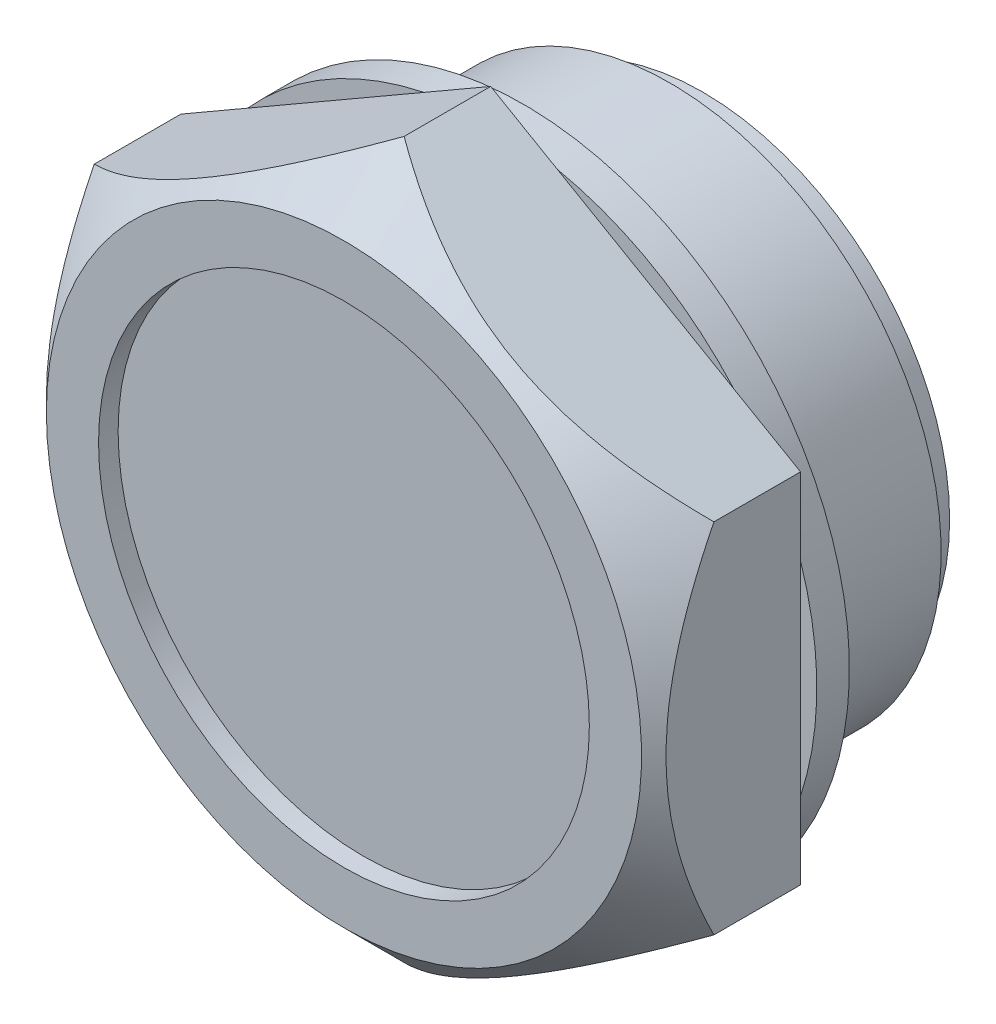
ISO-10303-21;
HEADER;
FILE_DESCRIPTION(('STEP AP214'),'2;1');
FILE_NAME('part.step','',(''),(''),'','','');
FILE_SCHEMA(('AUTOMOTIVE_DESIGN { 1 0 10303 214 1 1 1 1 }'));
ENDSEC;
DATA;
#1=APPLICATION_CONTEXT('core data for automotive mechanical design processes');
#2=APPLICATION_PROTOCOL_DEFINITION('international standard','automotive_design',2000,#1);
#3=PRODUCT_CONTEXT('',#1,'mechanical');
#4=PRODUCT('Part','Part','',(#3));
#5=PRODUCT_RELATED_PRODUCT_CATEGORY('part','',(#4));
#6=PRODUCT_DEFINITION_FORMATION('','',#4);
#7=PRODUCT_DEFINITION_CONTEXT('part definition',#1,'design');
#8=PRODUCT_DEFINITION('design','',#6,#7);
#9=PRODUCT_DEFINITION_SHAPE('','',#8);
#10=(LENGTH_UNIT() NAMED_UNIT(*) SI_UNIT(.MILLI.,.METRE.));
#11=(NAMED_UNIT(*) PLANE_ANGLE_UNIT() SI_UNIT($,.RADIAN.));
#12=(NAMED_UNIT(*) SI_UNIT($,.STERADIAN.) SOLID_ANGLE_UNIT());
#13=UNCERTAINTY_MEASURE_WITH_UNIT(LENGTH_MEASURE(1.E-05),#10,'distance_accuracy_value','');
#14=(GEOMETRIC_REPRESENTATION_CONTEXT(3) GLOBAL_UNCERTAINTY_ASSIGNED_CONTEXT((#13)) GLOBAL_UNIT_ASSIGNED_CONTEXT((#10,
#11,#12)) REPRESENTATION_CONTEXT('',''));
#15=CARTESIAN_POINT('',(0.,0.,0.));
#16=DIRECTION('',(0.,0.,1.));
#17=DIRECTION('',(1.,0.,0.));
#18=AXIS2_PLACEMENT_3D('',#15,#16,#17);
#19=CARTESIAN_POINT('',(0.,20.,2.));
#20=DIRECTION('',(0.,0.,-1.));
#21=DIRECTION('',(-1.,0.,0.));
#22=AXIS2_PLACEMENT_3D('',#19,#20,#21);
#23=PLANE('',#22);
#24=DIRECTION('',(-0.866025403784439,-0.5,0.));
#25=VECTOR('',#24,1.);
#26=CARTESIAN_POINT('',(19.0000000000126,-10.9696551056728,2.));
#27=LINE('',#26,#25);
#28=CARTESIAN_POINT('',(4.09167306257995,-19.5769816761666,2.));
#29=VERTEX_POINT('',#28);
#30=CARTESIAN_POINT('',(1.54832674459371E-08,-21.9393102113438,2.));
#31=VERTEX_POINT('',#30);
#32=EDGE_CURVE('E114',#29,#31,#27,.T.);
#33=ORIENTED_EDGE('',*,*,#32,.T.);
#34=DIRECTION('',(-0.866025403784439,0.5,0.));
#35=VECTOR('',#34,1.);
#36=CARTESIAN_POINT('',(1.54832674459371E-08,-21.9393102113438,2.));
#37=LINE('',#36,#35);
#38=CARTESIAN_POINT('',(-4.0916730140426,-19.576981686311,2.));
#39=VERTEX_POINT('',#38);
#40=EDGE_CURVE('E125',#31,#39,#37,.T.);
#41=ORIENTED_EDGE('',*,*,#40,.T.);
#42=CARTESIAN_POINT('',(0.,0.,2.));
#43=DIRECTION('',(0.,0.,-1.));
#44=DIRECTION('',(-1.,0.,0.));
#45=AXIS2_PLACEMENT_3D('',#42,#43,#44);
#46=CIRCLE('',#45,20.);
#47=EDGE_CURVE('E136',#29,#39,#46,.T.);
#48=ORIENTED_EDGE('',*,*,#47,.F.);
#49=EDGE_LOOP('',(#33,#41,#48));
#50=FACE_BOUND('',#49,.T.);
#51=ADVANCED_FACE('F15',(#50),#23,.T.);
#52=CARTESIAN_POINT('',(-14.9083269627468,-13.3319836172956,2.));
#53=VERTEX_POINT('',#52);
#54=CARTESIAN_POINT('',(-18.9999999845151,-10.9696550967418,2.));
#55=VERTEX_POINT('',#54);
#56=EDGE_CURVE('E135',#53,#55,#37,.T.);
#57=ORIENTED_EDGE('',*,*,#56,.T.);
#58=DIRECTION('',(0.,1.,0.));
#59=VECTOR('',#58,1.);
#60=CARTESIAN_POINT('',(-18.9999999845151,-10.9696550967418,2.));
#61=LINE('',#60,#59);
#62=CARTESIAN_POINT('',(-18.9999999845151,-6.24499804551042,2.));
#63=VERTEX_POINT('',#62);
#64=EDGE_CURVE('E164',#55,#63,#61,.T.);
#65=ORIENTED_EDGE('',*,*,#64,.T.);
#66=EDGE_CURVE('E209',#53,#63,#46,.T.);
#67=ORIENTED_EDGE('',*,*,#66,.F.);
#68=EDGE_LOOP('',(#57,#65,#67));
#69=FACE_BOUND('',#68,.T.);
#70=ADVANCED_FACE('F315',(#69),#23,.T.);
#71=CARTESIAN_POINT('',(-18.9999999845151,6.2449980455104,2.));
#72=VERTEX_POINT('',#71);
#73=CARTESIAN_POINT('',(-18.9999999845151,10.9696551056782,2.));
#74=VERTEX_POINT('',#73);
#75=EDGE_CURVE('E133',#72,#74,#61,.T.);
#76=ORIENTED_EDGE('',*,*,#75,.T.);
#77=DIRECTION('',(0.866025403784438,0.5,0.));
#78=VECTOR('',#77,1.);
#79=CARTESIAN_POINT('',(-18.9999999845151,10.9696551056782,2.));
#80=LINE('',#79,#78);
#81=CARTESIAN_POINT('',(-14.908326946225,13.331983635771,2.));
#82=VERTEX_POINT('',#81);
#83=EDGE_CURVE('E169',#74,#82,#80,.T.);
#84=ORIENTED_EDGE('',*,*,#83,.T.);
#85=EDGE_CURVE('E210',#72,#82,#46,.T.);
#86=ORIENTED_EDGE('',*,*,#85,.F.);
#87=EDGE_LOOP('',(#76,#84,#86));
#88=FACE_BOUND('',#87,.T.);
#89=ADVANCED_FACE('F320',(#88),#23,.T.);
#90=CARTESIAN_POINT('',(-4.09167303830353,19.5769816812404,2.));
#91=VERTEX_POINT('',#90);
#92=CARTESIAN_POINT('',(1.37390099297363E-12,21.9393102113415,2.));
#93=VERTEX_POINT('',#92);
#94=EDGE_CURVE('E167',#91,#93,#80,.T.);
#95=ORIENTED_EDGE('',*,*,#94,.T.);
#96=DIRECTION('',(0.866025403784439,-0.5,0.));
#97=VECTOR('',#96,1.);
#98=CARTESIAN_POINT('',(1.37390099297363E-12,21.9393102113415,2.));
#99=LINE('',#98,#97);
#100=CARTESIAN_POINT('',(4.09167303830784,19.5769816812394,2.));
#101=VERTEX_POINT('',#100);
#102=EDGE_CURVE('E175',#93,#101,#99,.T.);
#103=ORIENTED_EDGE('',*,*,#102,.T.);
#104=EDGE_CURVE('E215',#91,#101,#46,.T.);
#105=ORIENTED_EDGE('',*,*,#104,.F.);
#106=EDGE_LOOP('',(#95,#103,#105));
#107=FACE_BOUND('',#106,.T.);
#108=ADVANCED_FACE('F334',(#107),#23,.T.);
#109=CARTESIAN_POINT('',(19.0000000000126,-10.9696551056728,2.));
#110=VERTEX_POINT('',#109);
#111=CARTESIAN_POINT('',(14.9083269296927,-13.331983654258,2.));
#112=VERTEX_POINT('',#111);
#113=EDGE_CURVE('E142',#110,#112,#27,.T.);
#114=ORIENTED_EDGE('',*,*,#113,.T.);
#115=CARTESIAN_POINT('',(18.9999999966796,-6.24499800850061,2.));
#116=VERTEX_POINT('',#115);
#117=EDGE_CURVE('E599',#116,#112,#46,.T.);
#118=ORIENTED_EDGE('',*,*,#117,.F.);
#119=DIRECTION('',(7.05455941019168E-10,-1.,0.));
#120=VECTOR('',#119,1.);
#121=CARTESIAN_POINT('',(18.9999999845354,10.969655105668,2.));
#122=LINE('',#121,#120);
#123=EDGE_CURVE('E179',#116,#110,#122,.T.);
#124=ORIENTED_EDGE('',*,*,#123,.T.);
#125=EDGE_LOOP('',(#114,#118,#124));
#126=FACE_BOUND('',#125,.T.);
#127=ADVANCED_FACE('F325',(#126),#23,.T.);
#128=CARTESIAN_POINT('',(0.,0.,-11.));
#129=DIRECTION('',(0.,0.,-1.));
#130=DIRECTION('',(-1.,0.,0.));
#131=AXIS2_PLACEMENT_3D('',#128,#129,#130);
#132=PLANE('',#131);
#133=CARTESIAN_POINT('',(0.,0.,-11.));
#134=DIRECTION('',(0.,0.,-1.));
#135=DIRECTION('',(-1.,0.,0.));
#136=AXIS2_PLACEMENT_3D('',#133,#134,#135);
#137=CIRCLE('',#136,15.1455);
#138=CARTESIAN_POINT('',(-15.1455,0.,-11.));
#139=VERTEX_POINT('',#138);
#140=EDGE_CURVE('E231',#139,#139,#137,.T.);
#141=ORIENTED_EDGE('',*,*,#140,.T.);
#142=EDGE_LOOP('',(#141));
#143=FACE_BOUND('',#142,.T.);
#144=ADVANCED_FACE('F17',(#143),#132,.T.);
#145=CARTESIAN_POINT('',(0.,0.,-21.));
#146=DIRECTION('',(0.,0.,-1.));
#147=DIRECTION('',(-1.,0.,0.));
#148=AXIS2_PLACEMENT_3D('',#145,#146,#147);
#149=CYLINDRICAL_SURFACE('',#148,15.1455);
#150=ORIENTED_EDGE('',*,*,#140,.F.);
#151=EDGE_LOOP('',(#150));
#152=FACE_BOUND('',#151,.T.);
#153=CARTESIAN_POINT('',(0.,0.,-9.));
#154=DIRECTION('',(0.,0.,-1.));
#155=DIRECTION('',(-1.,0.,0.));
#156=AXIS2_PLACEMENT_3D('',#153,#154,#155);
#157=CIRCLE('',#156,15.1455);
#158=CARTESIAN_POINT('',(-15.1455,0.,-9.));
#159=VERTEX_POINT('',#158);
#160=EDGE_CURVE('E227',#159,#159,#157,.T.);
#161=ORIENTED_EDGE('',*,*,#160,.T.);
#162=EDGE_LOOP('',(#161));
#163=FACE_BOUND('',#162,.T.);
#164=ADVANCED_FACE('F340',(#152,#163),#149,.T.);
#165=CARTESIAN_POINT('',(0.,15.1455,-9.));
#166=DIRECTION('',(0.,0.,-1.));
#167=DIRECTION('',(-1.,0.,0.));
#168=AXIS2_PLACEMENT_3D('',#165,#166,#167);
#169=PLANE('',#168);
#170=CARTESIAN_POINT('',(0.,0.,-9.));
#171=DIRECTION('',(0.,0.,-1.));
#172=DIRECTION('',(-1.,0.,0.));
#173=AXIS2_PLACEMENT_3D('',#170,#171,#172);
#174=CIRCLE('',#173,16.6245);
#175=CARTESIAN_POINT('',(-16.6245,0.,-9.));
#176=VERTEX_POINT('',#175);
#177=EDGE_CURVE('E223',#176,#176,#174,.T.);
#178=ORIENTED_EDGE('',*,*,#177,.T.);
#179=EDGE_LOOP('',(#178));
#180=FACE_BOUND('',#179,.T.);
#181=ORIENTED_EDGE('',*,*,#160,.F.);
#182=EDGE_LOOP('',(#181));
#183=FACE_BOUND('',#182,.T.);
#184=ADVANCED_FACE('F537',(#180,#183),#169,.T.);
#185=CARTESIAN_POINT('',(0.,0.,-21.));
#186=DIRECTION('',(0.,0.,-1.));
#187=DIRECTION('',(-1.,0.,0.));
#188=AXIS2_PLACEMENT_3D('',#185,#186,#187);
#189=CYLINDRICAL_SURFACE('',#188,16.6245);
#190=ORIENTED_EDGE('',*,*,#177,.F.);
#191=EDGE_LOOP('',(#190));
#192=FACE_BOUND('',#191,.T.);
#193=CARTESIAN_POINT('',(0.,0.,0.));
#194=DIRECTION('',(0.,0.,-1.));
#195=DIRECTION('',(-1.,0.,0.));
#196=AXIS2_PLACEMENT_3D('',#193,#194,#195);
#197=CIRCLE('',#196,16.6245);
#198=CARTESIAN_POINT('',(-16.6245,0.,0.));
#199=VERTEX_POINT('',#198);
#200=EDGE_CURVE('E219',#199,#199,#197,.T.);
#201=ORIENTED_EDGE('',*,*,#200,.T.);
#202=EDGE_LOOP('',(#201));
#203=FACE_BOUND('',#202,.T.);
#204=ADVANCED_FACE('F529',(#192,#203),#189,.T.);
#205=CARTESIAN_POINT('',(0.,16.6245,0.));
#206=DIRECTION('',(0.,0.,-1.));
#207=DIRECTION('',(-1.,0.,0.));
#208=AXIS2_PLACEMENT_3D('',#205,#206,#207);
#209=PLANE('',#208);
#210=CARTESIAN_POINT('',(0.,0.,0.));
#211=DIRECTION('',(0.,0.,-1.));
#212=DIRECTION('',(-1.,0.,0.));
#213=AXIS2_PLACEMENT_3D('',#210,#211,#212);
#214=CIRCLE('',#213,20.);
#215=CARTESIAN_POINT('',(-20.,0.,0.));
#216=VERTEX_POINT('',#215);
#217=EDGE_CURVE('E214',#216,#216,#214,.T.);
#218=ORIENTED_EDGE('',*,*,#217,.T.);
#219=EDGE_LOOP('',(#218));
#220=FACE_BOUND('',#219,.T.);
#221=ORIENTED_EDGE('',*,*,#200,.F.);
#222=EDGE_LOOP('',(#221));
#223=FACE_BOUND('',#222,.T.);
#224=ADVANCED_FACE('F330',(#220,#223),#209,.T.);
#225=CARTESIAN_POINT('',(0.,0.,-21.));
#226=DIRECTION('',(0.,0.,-1.));
#227=DIRECTION('',(-1.,0.,0.));
#228=AXIS2_PLACEMENT_3D('',#225,#226,#227);
#229=CYLINDRICAL_SURFACE('',#228,20.);
#230=ORIENTED_EDGE('',*,*,#85,.T.);
#231=CARTESIAN_POINT('',(0.,0.,2.));
#232=DIRECTION('',(0.,0.,-1.));
#233=DIRECTION('',(-1.,0.,0.));
#234=AXIS2_PLACEMENT_3D('',#231,#232,#233);
#235=CIRCLE('',#234,20.);
#236=EDGE_CURVE('E203',#91,#82,#235,.F.);
#237=ORIENTED_EDGE('',*,*,#236,.F.);
#238=ORIENTED_EDGE('',*,*,#104,.T.);
#239=CARTESIAN_POINT('',(14.908326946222,13.3319836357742,2.));
#240=VERTEX_POINT('',#239);
#241=EDGE_CURVE('E378',#240,#101,#235,.F.);
#242=ORIENTED_EDGE('',*,*,#241,.F.);
#243=CARTESIAN_POINT('',(18.9999999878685,6.24499803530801,2.));
#244=VERTEX_POINT('',#243);
#245=EDGE_CURVE('E395',#240,#244,#46,.T.);
#246=ORIENTED_EDGE('',*,*,#245,.T.);
#247=EDGE_CURVE('E375',#116,#244,#235,.F.);
#248=ORIENTED_EDGE('',*,*,#247,.F.);
#249=ORIENTED_EDGE('',*,*,#117,.T.);
#250=EDGE_CURVE('E373',#29,#112,#235,.F.);
#251=ORIENTED_EDGE('',*,*,#250,.F.);
#252=ORIENTED_EDGE('',*,*,#47,.T.);
#253=EDGE_CURVE('E204',#53,#39,#235,.F.);
#254=ORIENTED_EDGE('',*,*,#253,.F.);
#255=ORIENTED_EDGE('',*,*,#66,.T.);
#256=EDGE_CURVE('E120',#72,#63,#235,.F.);
#257=ORIENTED_EDGE('',*,*,#256,.F.);
#258=EDGE_LOOP('',(#230,#237,#238,#242,#246,#248,#249,#251,#252,#254,#255,#257));
#259=FACE_BOUND('',#258,.T.);
#260=ORIENTED_EDGE('',*,*,#217,.F.);
#261=EDGE_LOOP('',(#260));
#262=FACE_BOUND('',#261,.T.);
#263=ADVANCED_FACE('F323',(#259,#262),#229,.T.);
#264=CARTESIAN_POINT('',(18.9999999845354,10.969655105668,2.));
#265=VERTEX_POINT('',#264);
#266=EDGE_CURVE('E173',#240,#265,#99,.T.);
#267=ORIENTED_EDGE('',*,*,#266,.T.);
#268=EDGE_CURVE('E181',#265,#244,#122,.T.);
#269=ORIENTED_EDGE('',*,*,#268,.T.);
#270=ORIENTED_EDGE('',*,*,#245,.F.);
#271=EDGE_LOOP('',(#267,#269,#270));
#272=FACE_BOUND('',#271,.T.);
#273=ADVANCED_FACE('F300',(#272),#23,.T.);
#274=CARTESIAN_POINT('',(-30.,-30.,2.));
#275=DIRECTION('',(0.,0.,-1.));
#276=DIRECTION('',(-1.,0.,0.));
#277=AXIS2_PLACEMENT_3D('',#274,#275,#276);
#278=PLANE('',#277);
#279=ORIENTED_EDGE('',*,*,#236,.T.);
#280=EDGE_CURVE('E174',#82,#91,#80,.T.);
#281=ORIENTED_EDGE('',*,*,#280,.T.);
#282=EDGE_LOOP('',(#279,#281));
#283=FACE_BOUND('',#282,.T.);
#284=ADVANCED_FACE('F297',(#283),#278,.F.);
#285=ORIENTED_EDGE('',*,*,#241,.T.);
#286=EDGE_CURVE('E180',#101,#240,#99,.T.);
#287=ORIENTED_EDGE('',*,*,#286,.T.);
#288=EDGE_LOOP('',(#285,#287));
#289=FACE_BOUND('',#288,.T.);
#290=ADVANCED_FACE('F299',(#289),#278,.F.);
#291=ORIENTED_EDGE('',*,*,#247,.T.);
#292=EDGE_CURVE('E37',#244,#116,#122,.T.);
#293=ORIENTED_EDGE('',*,*,#292,.T.);
#294=EDGE_LOOP('',(#291,#293));
#295=FACE_BOUND('',#294,.T.);
#296=ADVANCED_FACE('F397',(#295),#278,.F.);
#297=ORIENTED_EDGE('',*,*,#250,.T.);
#298=EDGE_CURVE('E139',#112,#29,#27,.T.);
#299=ORIENTED_EDGE('',*,*,#298,.T.);
#300=EDGE_LOOP('',(#297,#299));
#301=FACE_BOUND('',#300,.T.);
#302=ADVANCED_FACE('F402',(#301),#278,.F.);
#303=ORIENTED_EDGE('',*,*,#253,.T.);
#304=EDGE_CURVE('E128',#39,#53,#37,.T.);
#305=ORIENTED_EDGE('',*,*,#304,.T.);
#306=EDGE_LOOP('',(#303,#305));
#307=FACE_BOUND('',#306,.T.);
#308=ADVANCED_FACE('F407',(#307),#278,.F.);
#309=ORIENTED_EDGE('',*,*,#256,.T.);
#310=EDGE_CURVE('E168',#63,#72,#61,.T.);
#311=ORIENTED_EDGE('',*,*,#310,.T.);
#312=EDGE_LOOP('',(#309,#311));
#313=FACE_BOUND('',#312,.T.);
#314=ADVANCED_FACE('F302',(#313),#278,.F.);
#315=CARTESIAN_POINT('',(19.0000000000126,-10.9696551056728,2.));
#316=DIRECTION('',(-0.5,0.866025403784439,0.));
#317=DIRECTION('',(0.866025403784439,0.5,0.));
#318=AXIS2_PLACEMENT_3D('',#315,#316,#317);
#319=PLANE('',#318);
#320=DIRECTION('',(0.,0.,1.));
#321=VECTOR('',#320,1.);
#322=CARTESIAN_POINT('',(1.54832674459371E-08,-21.9393102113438,2.));
#323=LINE('',#322,#321);
#324=CARTESIAN_POINT('',(1.54832674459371E-08,-21.9393102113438,7.3106897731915));
#325=VERTEX_POINT('',#324);
#326=EDGE_CURVE('E109',#31,#325,#323,.T.);
#327=ORIENTED_EDGE('',*,*,#326,.F.);
#328=ORIENTED_EDGE('',*,*,#32,.F.);
#329=ORIENTED_EDGE('',*,*,#298,.F.);
#330=ORIENTED_EDGE('',*,*,#113,.F.);
#331=DIRECTION('',(0.,0.,1.));
#332=VECTOR('',#331,1.);
#333=CARTESIAN_POINT('',(19.0000000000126,-10.9696551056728,2.));
#334=LINE('',#333,#332);
#335=CARTESIAN_POINT('',(19.0000000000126,-10.9696551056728,7.3106897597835));
#336=VERTEX_POINT('',#335);
#337=EDGE_CURVE('E185',#110,#336,#334,.T.);
#338=ORIENTED_EDGE('',*,*,#337,.T.);
#339=CARTESIAN_POINT('',(-0.000199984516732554,-21.9394256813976,7.3105743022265));
#340=CARTESIAN_POINT('',(0.326448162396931,-21.7508352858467,7.49913513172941));
#341=CARTESIAN_POINT('',(0.655654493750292,-21.5607679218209,7.68194200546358));
#342=CARTESIAN_POINT('',(1.31958163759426,-21.1774494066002,8.03422015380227));
#343=CARTESIAN_POINT('',(1.65430534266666,-20.9841965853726,8.20368414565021));
#344=CARTESIAN_POINT('',(2.33124402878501,-20.5933658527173,8.52816648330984));
#345=CARTESIAN_POINT('',(2.67349092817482,-20.3957695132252,8.68309656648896));
#346=CARTESIAN_POINT('',(3.36360611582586,-19.9973313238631,8.97514614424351));
#347=CARTESIAN_POINT('',(3.71147353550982,-19.7964899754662,9.11226836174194));
#348=CARTESIAN_POINT('',(4.40723537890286,-19.3947916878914,9.36436398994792));
#349=CARTESIAN_POINT('',(4.75504431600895,-19.1939841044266,9.4796502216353));
#350=CARTESIAN_POINT('',(5.45554162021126,-18.7895517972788,9.68836448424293));
#351=CARTESIAN_POINT('',(5.80822946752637,-18.5859273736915,9.78179482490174));
#352=CARTESIAN_POINT('',(6.51695983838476,-18.1767417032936,9.94444948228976));
#353=CARTESIAN_POINT('',(6.87299292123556,-17.9711859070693,10.0137283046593));
#354=CARTESIAN_POINT('',(7.5880927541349,-17.5583228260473,10.1265403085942));
#355=CARTESIAN_POINT('',(7.94715904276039,-17.3510158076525,10.1700773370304));
#356=CARTESIAN_POINT('',(8.56458968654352,-16.9945420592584,10.2216376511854));
#357=CARTESIAN_POINT('',(8.82255417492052,-16.8456061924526,10.2362393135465));
#358=CARTESIAN_POINT('',(9.3387879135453,-16.5475585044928,10.2514232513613));
#359=CARTESIAN_POINT('',(9.59705714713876,-16.3984466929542,10.2520062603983));
#360=CARTESIAN_POINT('',(10.1134238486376,-16.1003222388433,10.2391389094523));
#361=CARTESIAN_POINT('',(10.3715212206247,-15.9513096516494,10.2256834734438));
#362=CARTESIAN_POINT('',(10.8868961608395,-15.6537577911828,10.1849400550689));
#363=CARTESIAN_POINT('',(11.1441737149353,-15.5052185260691,10.1576518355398));
#364=CARTESIAN_POINT('',(11.6576545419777,-15.2087602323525,10.0896114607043));
#365=CARTESIAN_POINT('',(11.9138564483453,-15.0608419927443,10.048845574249));
#366=CARTESIAN_POINT('',(12.4244831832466,-14.7660315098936,9.95443818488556));
#367=CARTESIAN_POINT('',(12.6789078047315,-14.6191393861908,9.90079520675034));
#368=CARTESIAN_POINT('',(13.438826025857,-14.1804003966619,9.72160211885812));
#369=CARTESIAN_POINT('',(13.9411555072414,-13.8903803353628,9.5777615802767));
#370=CARTESIAN_POINT('',(14.8327595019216,-13.3756125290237,9.28185516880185));
#371=CARTESIAN_POINT('',(15.2240256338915,-13.149714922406,9.13757396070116));
#372=CARTESIAN_POINT('',(15.9995498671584,-12.7019657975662,8.82576281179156));
#373=CARTESIAN_POINT('',(16.3838077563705,-12.4801144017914,8.65823216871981));
#374=CARTESIAN_POINT('',(17.1440862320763,-12.0411674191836,8.30367760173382));
#375=CARTESIAN_POINT('',(17.5201284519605,-11.8240593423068,8.11671498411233));
#376=CARTESIAN_POINT('',(18.2652503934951,-11.3938629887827,7.7257504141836));
#377=CARTESIAN_POINT('',(18.6343342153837,-11.1807723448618,7.52175890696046));
#378=CARTESIAN_POINT('',(19.0002000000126,-10.969539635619,7.310574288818));
#379=B_SPLINE_CURVE_WITH_KNOTS('',3,(#339,#340,#341,#342,#343,#344,#345,#346,#347,#348,#349,
#350,#351,#352,#353,#354,#355,#356,#357,#358,#359,#360,#361,#362,#363,#364,#365,#366,#367,#368,
#369,#370,#371,#372,#373,#374,#375,#376,#377,#378),.UNSPECIFIED.,.F.,.F.,(4,2,2,2,2,2,2,2,2,2,2,
2,2,2,2,2,2,2,2,4),(0.,1.26511678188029,2.53091936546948,3.80396921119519,5.07682417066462,
6.3297748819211,7.58259312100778,8.83256538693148,10.0823508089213,10.9767333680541,
11.8710691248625,12.7657283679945,13.660402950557,14.5559918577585,15.4516834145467,
17.2424005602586,18.6645955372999,20.0868334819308,21.5047132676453,22.9217296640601),.UNSPECIFIED.);
#380=EDGE_CURVE('E9',#325,#336,#379,.T.);
#381=ORIENTED_EDGE('',*,*,#380,.F.);
#382=EDGE_LOOP('',(#327,#328,#329,#330,#338,#381));
#383=FACE_BOUND('',#382,.T.);
#384=ADVANCED_FACE('F111',(#383),#319,.F.);
#385=CARTESIAN_POINT('',(1.54832674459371E-08,-21.9393102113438,2.));
#386=DIRECTION('',(0.5,0.866025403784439,0.));
#387=DIRECTION('',(0.866025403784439,-0.5,0.));
#388=AXIS2_PLACEMENT_3D('',#385,#386,#387);
#389=PLANE('',#388);
#390=DIRECTION('',(0.,0.,1.));
#391=VECTOR('',#390,1.);
#392=CARTESIAN_POINT('',(-18.9999999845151,-10.9696550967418,2.));
#393=LINE('',#392,#391);
#394=CARTESIAN_POINT('',(-18.9999999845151,-10.9696550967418,7.3106897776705));
#395=VERTEX_POINT('',#394);
#396=EDGE_CURVE('E121',#55,#395,#393,.T.);
#397=ORIENTED_EDGE('',*,*,#396,.F.);
#398=ORIENTED_EDGE('',*,*,#56,.F.);
#399=ORIENTED_EDGE('',*,*,#304,.F.);
#400=ORIENTED_EDGE('',*,*,#40,.F.);
#401=ORIENTED_EDGE('',*,*,#326,.T.);
#402=CARTESIAN_POINT('',(-19.0001999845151,-10.969539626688,7.310574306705));
#403=CARTESIAN_POINT('',(-18.6735518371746,-11.1581300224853,7.4991351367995));
#404=CARTESIAN_POINT('',(-18.3443455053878,-11.3481973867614,7.68194201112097));
#405=CARTESIAN_POINT('',(-17.6804183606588,-11.731515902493,8.03422016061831));
#406=CARTESIAN_POINT('',(-17.3456946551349,-11.9247687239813,8.20368415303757));
#407=CARTESIAN_POINT('',(-16.6687559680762,-12.3155994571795,8.52816649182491));
#408=CARTESIAN_POINT('',(-16.3265090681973,-12.513195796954,8.68309657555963));
#409=CARTESIAN_POINT('',(-15.6363938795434,-12.9116339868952,8.97514615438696));
#410=CARTESIAN_POINT('',(-15.2885264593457,-13.1124753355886,9.11226837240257));
#411=CARTESIAN_POINT('',(-14.5927646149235,-13.5141736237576,9.36436400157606));
#412=CARTESIAN_POINT('',(-14.2449556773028,-13.7149812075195,9.47965023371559));
#413=CARTESIAN_POINT('',(-13.5444583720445,-14.119413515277,9.68836449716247));
#414=CARTESIAN_POINT('',(-13.191770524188,-14.3230379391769,9.78179483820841));
#415=CARTESIAN_POINT('',(-12.4830401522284,-14.7322236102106,9.94444949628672));
#416=CARTESIAN_POINT('',(-12.127007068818,-14.937779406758,10.01372831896));
#417=CARTESIAN_POINT('',(-11.4119072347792,-15.3506424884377,10.1265403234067));
#418=CARTESIAN_POINT('',(-11.052840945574,-15.5579495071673,10.1700773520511));
#419=CARTESIAN_POINT('',(-10.4354103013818,-15.9144232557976,10.2216376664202));
#420=CARTESIAN_POINT('',(-10.1774458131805,-16.063359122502,10.2362393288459));
#421=CARTESIAN_POINT('',(-9.66121207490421,-16.3614068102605,10.251423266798));
#422=CARTESIAN_POINT('',(-9.40294284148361,-16.5105186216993,10.2520062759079));
#423=CARTESIAN_POINT('',(-8.88657614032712,-16.8086430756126,10.2391389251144));
#424=CARTESIAN_POINT('',(-8.62847876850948,-16.9576556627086,10.2256834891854));
#425=CARTESIAN_POINT('',(-8.11310382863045,-17.2552075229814,10.1849400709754));
#426=CARTESIAN_POINT('',(-7.85582627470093,-17.403746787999,10.1576518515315));
#427=CARTESIAN_POINT('',(-7.34234544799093,-17.7002050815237,10.0896114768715));
#428=CARTESIAN_POINT('',(-7.08614354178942,-17.8481233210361,10.0488455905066));
#429=CARTESIAN_POINT('',(-6.57551680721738,-18.1429338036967,9.95443820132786));
#430=CARTESIAN_POINT('',(-6.32109218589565,-18.2898259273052,9.90079522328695));
#431=CARTESIAN_POINT('',(-5.5611739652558,-18.7285649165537,9.72160213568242));
#432=CARTESIAN_POINT('',(-5.05884448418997,-19.0185849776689,9.57776159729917));
#433=CARTESIAN_POINT('',(-4.1672404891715,-19.5333527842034,9.28185518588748));
#434=CARTESIAN_POINT('',(-3.77597435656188,-19.7592503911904,9.13757397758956));
#435=CARTESIAN_POINT('',(-3.00045012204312,-20.2069995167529,8.82576282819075));
#436=CARTESIAN_POINT('',(-2.61619223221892,-20.4288509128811,8.65823218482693));
#437=CARTESIAN_POINT('',(-1.85591375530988,-20.8677978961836,8.30367761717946));
#438=CARTESIAN_POINT('',(-1.47987153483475,-21.0849059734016,8.1167149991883));
#439=CARTESIAN_POINT('',(-0.734749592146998,-21.5151023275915,7.72575042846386));
#440=CARTESIAN_POINT('',(-0.365665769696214,-21.728192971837,7.52175892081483));
#441=CARTESIAN_POINT('',(0.000200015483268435,-21.9394256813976,7.310574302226));
#442=B_SPLINE_CURVE_WITH_KNOTS('',3,(#402,#403,#404,#405,#406,#407,#408,#409,#410,#411,#412,
#413,#414,#415,#416,#417,#418,#419,#420,#421,#422,#423,#424,#425,#426,#427,#428,#429,#430,#431,
#432,#433,#434,#435,#436,#437,#438,#439,#440,#441),.UNSPECIFIED.,.F.,.F.,(4,2,2,2,2,2,2,2,2,2,2,
2,2,2,2,2,2,2,2,4),(0.,1.26511678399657,2.53091936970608,3.80396921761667,5.0768241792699,
6.32977489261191,7.58259313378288,8.83256540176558,10.0823508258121,10.976733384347,
11.8710691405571,12.765728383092,13.6604029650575,14.555991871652,15.4516834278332,
17.2424005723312,18.6645955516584,20.0868334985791,21.5047132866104,22.9217296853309),.UNSPECIFIED.);
#443=EDGE_CURVE('E30',#395,#325,#442,.T.);
#444=ORIENTED_EDGE('',*,*,#443,.F.);
#445=EDGE_LOOP('',(#397,#398,#399,#400,#401,#444));
#446=FACE_BOUND('',#445,.T.);
#447=ADVANCED_FACE('F126',(#446),#389,.F.);
#448=CARTESIAN_POINT('',(-18.9999999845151,-10.9696550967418,2.));
#449=DIRECTION('',(1.,0.,0.));
#450=DIRECTION('',(0.,0.,-1.));
#451=AXIS2_PLACEMENT_3D('',#448,#449,#450);
#452=PLANE('',#451);
#453=DIRECTION('',(0.,0.,1.));
#454=VECTOR('',#453,1.);
#455=CARTESIAN_POINT('',(-18.9999999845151,10.9696551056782,2.));
#456=LINE('',#455,#454);
#457=CARTESIAN_POINT('',(-18.9999999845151,10.9696551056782,7.3106897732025));
#458=VERTEX_POINT('',#457);
#459=EDGE_CURVE('E194',#74,#458,#456,.T.);
#460=ORIENTED_EDGE('',*,*,#459,.F.);
#461=ORIENTED_EDGE('',*,*,#75,.F.);
#462=ORIENTED_EDGE('',*,*,#310,.F.);
#463=ORIENTED_EDGE('',*,*,#64,.F.);
#464=ORIENTED_EDGE('',*,*,#396,.T.);
#465=CARTESIAN_POINT('',(-18.9999999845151,-22.5911293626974,-0.26879276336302));
#466=CARTESIAN_POINT('',(-18.9999999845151,-22.3176575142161,-0.0595046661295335));
#467=CARTESIAN_POINT('',(-18.9999999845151,-22.0434298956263,0.148795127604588));
#468=CARTESIAN_POINT('',(-18.9999999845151,-21.4933367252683,0.563229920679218));
#469=CARTESIAN_POINT('',(-18.9999999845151,-21.2174711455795,0.769364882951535));
#470=CARTESIAN_POINT('',(-18.9999999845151,-20.3871177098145,1.38432154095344));
#471=CARTESIAN_POINT('',(-18.9999999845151,-19.8299958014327,1.78960089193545));
#472=CARTESIAN_POINT('',(-18.9999999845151,-18.7032990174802,2.59187362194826));
#473=CARTESIAN_POINT('',(-18.9999999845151,-18.1336611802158,2.98877877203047));
#474=CARTESIAN_POINT('',(-18.9999999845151,-16.9848484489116,3.76849498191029));
#475=CARTESIAN_POINT('',(-18.9999999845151,-16.4056742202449,4.15130701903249));
#476=CARTESIAN_POINT('',(-18.9999999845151,-15.2002239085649,4.92266731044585));
#477=CARTESIAN_POINT('',(-18.9999999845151,-14.5732425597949,5.31011888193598));
#478=CARTESIAN_POINT('',(-18.9999999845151,-13.3045770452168,6.06056087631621));
#479=CARTESIAN_POINT('',(-18.9999999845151,-12.6628904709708,6.42354725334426));
#480=CARTESIAN_POINT('',(-18.9999999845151,-11.3647113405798,7.11729742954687));
#481=CARTESIAN_POINT('',(-18.9999999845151,-10.708269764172,7.44815589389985));
#482=CARTESIAN_POINT('',(-18.9999999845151,-9.37700730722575,8.07023926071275));
#483=CARTESIAN_POINT('',(-18.9999999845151,-8.70219517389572,8.36148264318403));
#484=CARTESIAN_POINT('',(-18.9999999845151,-7.39691763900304,8.86894107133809));
#485=CARTESIAN_POINT('',(-18.9999999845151,-6.76820410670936,9.08962487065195));
#486=CARTESIAN_POINT('',(-18.9999999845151,-5.49489602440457,9.48064153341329));
#487=CARTESIAN_POINT('',(-18.9999999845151,-4.85030044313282,9.65097111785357));
#488=CARTESIAN_POINT('',(-18.9999999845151,-3.87993769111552,9.86040507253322));
#489=CARTESIAN_POINT('',(-18.9999999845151,-3.55897001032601,9.92216382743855));
#490=CARTESIAN_POINT('',(-18.9999999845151,-2.91448314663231,10.0303901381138));
#491=CARTESIAN_POINT('',(-18.9999999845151,-2.5909643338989,10.0768598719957));
#492=CARTESIAN_POINT('',(-18.9999999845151,-1.94204349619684,10.1537246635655));
#493=CARTESIAN_POINT('',(-18.9999999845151,-1.616641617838,10.1841209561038));
#494=CARTESIAN_POINT('',(-18.9999999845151,-0.964707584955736,10.2283041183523));
#495=CARTESIAN_POINT('',(-18.9999999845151,-0.638175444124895,10.2420911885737));
#496=CARTESIAN_POINT('',(-18.9999999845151,0.00164400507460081,10.252580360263));
#497=CARTESIAN_POINT('',(-18.9999999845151,0.314920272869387,10.2499658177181));
#498=CARTESIAN_POINT('',(-18.9999999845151,0.940957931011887,10.2292868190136));
#499=CARTESIAN_POINT('',(-18.9999999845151,1.25371932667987,10.2112225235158));
#500=CARTESIAN_POINT('',(-18.9999999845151,1.87799364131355,10.1599481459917));
#501=CARTESIAN_POINT('',(-18.9999999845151,2.18950655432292,10.1267379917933));
#502=CARTESIAN_POINT('',(-18.9999999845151,2.81065765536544,10.0457047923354));
#503=CARTESIAN_POINT('',(-18.9999999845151,3.12029559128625,9.9978798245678));
#504=CARTESIAN_POINT('',(-18.9999999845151,3.74257237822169,9.88737004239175));
#505=CARTESIAN_POINT('',(-18.9999999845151,4.05516696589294,9.82443657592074));
#506=CARTESIAN_POINT('',(-18.9999999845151,4.67735208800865,9.68509165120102));
#507=CARTESIAN_POINT('',(-18.9999999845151,4.98694224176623,9.60867850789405));
#508=CARTESIAN_POINT('',(-18.9999999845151,5.91051115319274,9.36074065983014));
#509=CARTESIAN_POINT('',(-18.9999999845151,6.51951581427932,9.17047584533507));
#510=CARTESIAN_POINT('',(-18.9999999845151,7.76334392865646,8.73397562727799));
#511=CARTESIAN_POINT('',(-18.9999999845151,8.39712588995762,8.48482402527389));
#512=CARTESIAN_POINT('',(-18.9999999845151,9.6483747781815,7.94808557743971));
#513=CARTESIAN_POINT('',(-18.9999999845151,10.2658341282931,7.66048124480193));
#514=CARTESIAN_POINT('',(-18.9999999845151,11.4873446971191,7.05366731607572));
#515=CARTESIAN_POINT('',(-18.9999999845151,12.0913468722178,6.73435984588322));
#516=CARTESIAN_POINT('',(-18.9999999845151,13.2854976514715,6.07117398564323));
#517=CARTESIAN_POINT('',(-18.9999999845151,13.8756483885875,5.72729941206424));
#518=CARTESIAN_POINT('',(-18.9999999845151,15.0150182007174,5.03728315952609));
#519=CARTESIAN_POINT('',(-18.9999999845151,15.5648179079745,4.69209517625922));
#520=CARTESIAN_POINT('',(-18.9999999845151,16.6549738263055,3.98707604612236));
#521=CARTESIAN_POINT('',(-18.9999999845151,17.1953293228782,3.62724379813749));
#522=CARTESIAN_POINT('',(-18.9999999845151,18.2634741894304,2.89846700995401));
#523=CARTESIAN_POINT('',(-18.9999999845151,18.7913297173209,2.52961920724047));
#524=CARTESIAN_POINT('',(-18.9999999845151,19.5777360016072,1.96898030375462));
#525=CARTESIAN_POINT('',(-18.9999999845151,19.838942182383,1.78089734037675));
#526=CARTESIAN_POINT('',(-18.9999999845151,20.3596980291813,1.40246252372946));
#527=CARTESIAN_POINT('',(-18.9999999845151,20.6192477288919,1.2121107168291));
#528=CARTESIAN_POINT('',(-18.9999999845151,20.878030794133,1.0207214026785));
#529=B_SPLINE_CURVE_WITH_KNOTS('',3,(#465,#466,#467,#468,#469,#470,#471,#472,#473,#474,#475,
#476,#477,#478,#479,#480,#481,#482,#483,#484,#485,#486,#487,#488,#489,#490,#491,#492,#493,#494,
#495,#496,#497,#498,#499,#500,#501,#502,#503,#504,#505,#506,#507,#508,#509,#510,#511,#512,#513,
#514,#515,#516,#517,#518,#519,#520,#521,#522,#523,#524,#525,#526,#527,#528),.UNSPECIFIED.,.F.,
.F.,(4,2,2,2,2,2,2,2,2,2,2,2,2,2,2,2,2,2,2,2,2,2,2,2,2,2,2,2,2,2,2,4),(0.,1.03309565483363,
2.06620897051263,4.13289932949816,6.215559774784,8.2980755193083,10.5087449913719,
12.7197791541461,14.9240871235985,17.1273632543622,19.124662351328,21.1220914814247,
22.1023517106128,23.0824722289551,24.0625174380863,25.0425508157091,25.9820311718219,
26.9215017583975,27.860976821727,28.8005755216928,29.7568490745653,30.7132422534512,
32.6253370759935,34.6668192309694,36.7092329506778,38.7581605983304,40.8067706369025,
42.7540368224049,44.7014496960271,46.6331773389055,47.5987940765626,48.564391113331),.UNSPECIFIED.);
#530=EDGE_CURVE('E282',#458,#395,#529,.F.);
#531=ORIENTED_EDGE('',*,*,#530,.F.);
#532=EDGE_LOOP('',(#460,#461,#462,#463,#464,#531));
#533=FACE_BOUND('',#532,.T.);
#534=ADVANCED_FACE('F270',(#533),#452,.F.);
#535=CARTESIAN_POINT('',(-18.9999999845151,10.9696551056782,2.));
#536=DIRECTION('',(0.5,-0.866025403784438,0.));
#537=DIRECTION('',(-0.866025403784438,-0.5,0.));
#538=AXIS2_PLACEMENT_3D('',#535,#536,#537);
#539=PLANE('',#538);
#540=DIRECTION('',(0.,0.,1.));
#541=VECTOR('',#540,1.);
#542=CARTESIAN_POINT('',(1.37390099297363E-12,21.9393102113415,2.));
#543=LINE('',#542,#541);
#544=CARTESIAN_POINT('',(1.37390099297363E-12,21.9393102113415,7.3106897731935));
#545=VERTEX_POINT('',#544);
#546=EDGE_CURVE('E190',#93,#545,#543,.T.);
#547=ORIENTED_EDGE('',*,*,#546,.F.);
#548=ORIENTED_EDGE('',*,*,#94,.F.);
#549=ORIENTED_EDGE('',*,*,#280,.F.);
#550=ORIENTED_EDGE('',*,*,#83,.F.);
#551=ORIENTED_EDGE('',*,*,#459,.T.);
#552=CARTESIAN_POINT('',(0.000200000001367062,21.9394256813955,7.3105743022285));
#553=CARTESIAN_POINT('',(-0.326448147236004,21.7508352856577,7.49913513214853));
#554=CARTESIAN_POINT('',(-0.655654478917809,21.5607679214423,7.68194200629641));
#555=CARTESIAN_POINT('',(-1.31958162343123,21.1774494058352,8.03422015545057));
#556=CARTESIAN_POINT('',(-1.65430532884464,20.9841965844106,8.20368414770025));
#557=CARTESIAN_POINT('',(-2.33124401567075,20.5933658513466,8.52816648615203));
#558=CARTESIAN_POINT('',(-2.67349091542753,20.3957695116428,8.68309656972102));
#559=CARTESIAN_POINT('',(-3.3636061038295,19.997331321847,8.97514614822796));
#560=CARTESIAN_POINT('',(-3.71147352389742,19.7964899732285,9.11226836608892));
#561=CARTESIAN_POINT('',(-4.40723536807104,19.394791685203,9.36436399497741));
#562=CARTESIAN_POINT('',(-4.75504430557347,19.1939841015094,9.47965022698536));
#563=CARTESIAN_POINT('',(-5.45554161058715,18.7895517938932,9.68836449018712));
#564=CARTESIAN_POINT('',(-5.8082294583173,18.5859273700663,9.78179483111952));
#565=CARTESIAN_POINT('',(-6.5169598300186,18.1767416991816,9.9444494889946));
#566=CARTESIAN_POINT('',(-6.8729929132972,17.9711859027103,10.013728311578));
#567=CARTESIAN_POINT('',(-7.58809274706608,17.5583228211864,10.1265403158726));
#568=CARTESIAN_POINT('',(-7.94715903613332,17.3510158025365,10.1700773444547));
#569=CARTESIAN_POINT('',(-8.5645896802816,16.9945420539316,10.2216376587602));
#570=CARTESIAN_POINT('',(-8.82255416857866,16.8456061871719,10.2362393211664));
#571=CARTESIAN_POINT('',(-9.33878790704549,16.5475584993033,10.2514232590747));
#572=CARTESIAN_POINT('',(-9.59705714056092,16.3984466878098,10.2520062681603));
#573=CARTESIAN_POINT('',(-10.113423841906,16.1003222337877,10.2391389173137));
#574=CARTESIAN_POINT('',(-10.3715212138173,15.9513096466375,10.225683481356));
#575=CARTESIAN_POINT('',(-10.8868961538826,15.6537577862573,10.1849400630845));
#576=CARTESIAN_POINT('',(-11.1441737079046,15.5052185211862,10.157651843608));
#577=CARTESIAN_POINT('',(-11.6576545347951,15.2087602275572,10.0896114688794));
#578=CARTESIAN_POINT('',(-11.9138564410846,15.0608419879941,10.0488455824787));
#579=CARTESIAN_POINT('',(-12.4244831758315,14.7660315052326,9.95443819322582));
#580=CARTESIAN_POINT('',(-12.67890779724,14.6191393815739,9.90079521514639));
#581=CARTESIAN_POINT('',(-13.4388260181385,14.180400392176,9.72160212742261));
#582=CARTESIAN_POINT('',(-13.9411554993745,13.8903803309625,9.57776158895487));
#583=CARTESIAN_POINT('',(-14.8327594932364,13.3756125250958,9.28185517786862));
#584=CARTESIAN_POINT('',(-15.2240256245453,13.1497149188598,9.13757397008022));
#585=CARTESIAN_POINT('',(-15.9995498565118,12.701965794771,8.82576282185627));
#586=CARTESIAN_POINT('',(-16.3838077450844,12.4801143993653,8.65823217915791));
#587=CARTESIAN_POINT('',(-17.1440862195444,12.0411674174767,8.30367761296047));
#588=CARTESIAN_POINT('',(-17.5201284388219,11.8240593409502,8.11671499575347));
#589=CARTESIAN_POINT('',(-18.2652503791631,11.3938629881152,7.7257504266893));
#590=CARTESIAN_POINT('',(-18.6343342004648,11.1807723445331,7.52175891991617));
#591=CARTESIAN_POINT('',(-19.0001999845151,10.9695396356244,7.310574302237));
#592=B_SPLINE_CURVE_WITH_KNOTS('',3,(#552,#553,#554,#555,#556,#557,#558,#559,#560,#561,#562,
#563,#564,#565,#566,#567,#568,#569,#570,#571,#572,#573,#574,#575,#576,#577,#578,#579,#580,#581,
#582,#583,#584,#585,#586,#587,#588,#589,#590,#591),.UNSPECIFIED.,.F.,.F.,(4,2,2,2,2,2,2,2,2,2,2,
2,2,2,2,2,2,2,2,4),(0.,1.26511678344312,2.53091936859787,3.80396921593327,5.07682417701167,
6.32977488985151,7.58259313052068,8.83256539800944,10.0823508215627,10.9767333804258,
11.8710691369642,12.7657283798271,13.6604029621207,14.5559918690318,15.4516834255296,
17.2424005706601,18.6645955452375,20.0868334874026,21.5047132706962,22.9217296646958),.UNSPECIFIED.);
#593=EDGE_CURVE('E274',#545,#458,#592,.T.);
#594=ORIENTED_EDGE('',*,*,#593,.F.);
#595=EDGE_LOOP('',(#547,#548,#549,#550,#551,#594));
#596=FACE_BOUND('',#595,.T.);
#597=ADVANCED_FACE('F265',(#596),#539,.F.);
#598=CARTESIAN_POINT('',(1.37390099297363E-12,21.9393102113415,2.));
#599=DIRECTION('',(-0.5,-0.866025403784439,0.));
#600=DIRECTION('',(-0.866025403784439,0.5,0.));
#601=AXIS2_PLACEMENT_3D('',#598,#599,#600);
#602=PLANE('',#601);
#603=DIRECTION('',(0.,0.,1.));
#604=VECTOR('',#603,1.);
#605=CARTESIAN_POINT('',(18.9999999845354,10.969655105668,2.));
#606=LINE('',#605,#604);
#607=CARTESIAN_POINT('',(18.9999999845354,10.9696551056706,7.3106897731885));
#608=VERTEX_POINT('',#607);
#609=EDGE_CURVE('E43',#265,#608,#606,.T.);
#610=ORIENTED_EDGE('',*,*,#609,.F.);
#611=ORIENTED_EDGE('',*,*,#266,.F.);
#612=ORIENTED_EDGE('',*,*,#286,.F.);
#613=ORIENTED_EDGE('',*,*,#102,.F.);
#614=ORIENTED_EDGE('',*,*,#546,.T.);
#615=CARTESIAN_POINT('',(19.0001999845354,10.9695396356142,7.3105743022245));
#616=CARTESIAN_POINT('',(18.6735518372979,11.158130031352,7.49913513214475));
#617=CARTESIAN_POINT('',(18.3443455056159,11.3481973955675,7.68194200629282));
#618=CARTESIAN_POINT('',(17.6804183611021,11.7315159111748,8.0342201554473));
#619=CARTESIAN_POINT('',(17.3456946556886,11.9247687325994,8.20368414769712));
#620=CARTESIAN_POINT('',(16.6687559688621,12.3155994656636,8.52816648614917));
#621=CARTESIAN_POINT('',(16.3265090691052,12.5131958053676,8.68309656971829));
#622=CARTESIAN_POINT('',(15.6363938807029,12.9116339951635,8.9751461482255));
#623=CARTESIAN_POINT('',(15.2885264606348,13.1124753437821,9.11226836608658));
#624=CARTESIAN_POINT('',(14.5927646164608,13.5141736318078,9.3643639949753));
#625=CARTESIAN_POINT('',(14.2449556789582,13.7149812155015,9.47965022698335));
#626=CARTESIAN_POINT('',(13.5444583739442,14.1194135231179,9.68836449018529));
#627=CARTESIAN_POINT('',(13.1917705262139,14.3230379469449,9.78179483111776));
#628=CARTESIAN_POINT('',(12.4830401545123,14.7322236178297,9.94444948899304));
#629=CARTESIAN_POINT('',(12.1270070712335,14.9377794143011,10.0137283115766));
#630=CARTESIAN_POINT('',(11.4119072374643,15.3506424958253,10.1265403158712));
#631=CARTESIAN_POINT('',(11.0528409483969,15.5579495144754,10.1700773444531));
#632=CARTESIAN_POINT('',(10.4354103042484,15.9144232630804,10.2216376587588));
#633=CARTESIAN_POINT('',(10.1774458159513,16.06335912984,10.236239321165));
#634=CARTESIAN_POINT('',(9.66121207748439,16.3614068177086,10.2514232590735));
#635=CARTESIAN_POINT('',(9.40294284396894,16.5105186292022,10.252006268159));
#636=CARTESIAN_POINT('',(8.88657614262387,16.8086430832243,10.2391389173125));
#637=CARTESIAN_POINT('',(8.6284787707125,16.9576556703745,10.2256834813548));
#638=CARTESIAN_POINT('',(8.1131038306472,17.2552075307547,10.1849400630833));
#639=CARTESIAN_POINT('',(7.85582627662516,17.4037467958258,10.1576518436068));
#640=CARTESIAN_POINT('',(7.34234544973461,17.7002050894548,10.0896114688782));
#641=CARTESIAN_POINT('',(7.08614354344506,17.848123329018,10.0488455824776));
#642=CARTESIAN_POINT('',(6.57551680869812,18.1429338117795,9.9544381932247));
#643=CARTESIAN_POINT('',(6.32109218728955,18.2898259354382,9.9007952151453));
#644=CARTESIAN_POINT('',(5.56117396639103,18.7285649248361,9.72160212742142));
#645=CARTESIAN_POINT('',(5.05884448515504,19.0185849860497,9.57776158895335));
#646=CARTESIAN_POINT('',(4.16724049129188,19.5333527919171,9.28185517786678));
#647=CARTESIAN_POINT('',(3.77597435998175,19.7592503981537,9.13757397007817));
#648=CARTESIAN_POINT('',(3.00045012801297,20.2069995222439,8.82576282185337));
#649=CARTESIAN_POINT('',(2.61619223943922,20.4288509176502,8.65823217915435));
#650=CARTESIAN_POINT('',(1.85591376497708,20.86779789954,8.3036776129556));
#651=CARTESIAN_POINT('',(1.47987154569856,21.0849059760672,8.11671499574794));
#652=CARTESIAN_POINT('',(0.734749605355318,21.5151023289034,7.72575042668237));
#653=CARTESIAN_POINT('',(0.36566578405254,21.7281929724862,7.52175891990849));
#654=CARTESIAN_POINT('',(-0.000199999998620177,21.9394256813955,7.3105743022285));
#655=B_SPLINE_CURVE_WITH_KNOTS('',3,(#615,#616,#617,#618,#619,#620,#621,#622,#623,#624,#625,
#626,#627,#628,#629,#630,#631,#632,#633,#634,#635,#636,#637,#638,#639,#640,#641,#642,#643,#644,
#645,#646,#647,#648,#649,#650,#651,#652,#653,#654),.UNSPECIFIED.,.F.,.F.,(4,2,2,2,2,2,2,2,2,2,2,
2,2,2,2,2,2,2,2,4),(0.,1.26511678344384,2.5309193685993,3.80396921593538,5.07682417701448,
6.32977488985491,7.58259313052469,8.83256539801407,10.082350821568,10.9767333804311,
11.8710691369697,12.7657283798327,13.6604029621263,14.5559918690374,15.4516834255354,
17.242400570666,18.6645955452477,20.086833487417,21.5047132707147,22.9217296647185),.UNSPECIFIED.);
#656=EDGE_CURVE('E244',#608,#545,#655,.T.);
#657=ORIENTED_EDGE('',*,*,#656,.F.);
#658=EDGE_LOOP('',(#610,#611,#612,#613,#614,#657));
#659=FACE_BOUND('',#658,.T.);
#660=ADVANCED_FACE('F259',(#659),#602,.F.);
#661=CARTESIAN_POINT('',(18.9999999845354,10.969655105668,2.));
#662=DIRECTION('',(-1.,-7.05455941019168E-10,0.));
#663=DIRECTION('',(-7.05455941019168E-10,1.,0.));
#664=AXIS2_PLACEMENT_3D('',#661,#662,#663);
#665=PLANE('',#664);
#666=ORIENTED_EDGE('',*,*,#337,.F.);
#667=ORIENTED_EDGE('',*,*,#123,.F.);
#668=ORIENTED_EDGE('',*,*,#292,.F.);
#669=ORIENTED_EDGE('',*,*,#268,.F.);
#670=ORIENTED_EDGE('',*,*,#609,.T.);
#671=CARTESIAN_POINT('',(19.0000000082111,-22.5911293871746,-0.268792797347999));
#672=CARTESIAN_POINT('',(19.0000000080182,-22.3176575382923,-0.0595046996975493));
#673=CARTESIAN_POINT('',(19.0000000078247,-22.0434299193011,0.148795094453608));
#674=CARTESIAN_POINT('',(19.0000000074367,-21.4933367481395,0.563229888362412));
#675=CARTESIAN_POINT('',(19.000000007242,-21.2174711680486,0.769364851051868));
#676=CARTESIAN_POINT('',(19.0000000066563,-20.3871177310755,1.38432151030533));
#677=CARTESIAN_POINT('',(19.0000000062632,-19.8299958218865,1.78960086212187));
#678=CARTESIAN_POINT('',(19.0000000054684,-18.7032990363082,2.59187359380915));
#679=CARTESIAN_POINT('',(19.0000000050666,-18.1336611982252,2.98877874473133));
#680=CARTESIAN_POINT('',(19.0000000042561,-16.9848484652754,3.76849495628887));
#681=CARTESIAN_POINT('',(19.0000000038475,-16.4056742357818,4.15130699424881));
#682=CARTESIAN_POINT('',(19.0000000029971,-15.2002239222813,4.92266728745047));
#683=CARTESIAN_POINT('',(19.0000000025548,-14.5732425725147,5.31011885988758));
#684=CARTESIAN_POINT('',(19.0000000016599,-13.3045770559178,6.06056085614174));
#685=CARTESIAN_POINT('',(19.0000000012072,-12.6628904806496,6.42354723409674));
#686=CARTESIAN_POINT('',(19.0000000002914,-11.3647113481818,7.1172974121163));
#687=CARTESIAN_POINT('',(18.9999999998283,-10.7082697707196,7.4481558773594));
#688=CARTESIAN_POINT('',(18.9999999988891,-9.37700731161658,8.07023924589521));
#689=CARTESIAN_POINT('',(18.9999999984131,-8.70219517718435,8.36148262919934));
#690=CARTESIAN_POINT('',(18.9999999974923,-7.39691764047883,8.86894105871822));
#691=CARTESIAN_POINT('',(18.9999999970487,-6.76820410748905,9.08962485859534));
#692=CARTESIAN_POINT('',(18.9999999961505,-5.49489602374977,9.4806415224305));
#693=CARTESIAN_POINT('',(18.9999999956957,-4.85030044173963,9.65097110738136));
#694=CARTESIAN_POINT('',(18.9999999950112,-3.87993768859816,9.86040506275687));
#695=CARTESIAN_POINT('',(18.9999999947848,-3.55897000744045,9.92216381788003));
#696=CARTESIAN_POINT('',(18.9999999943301,-2.91448314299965,10.0303901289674));
#697=CARTESIAN_POINT('',(18.9999999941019,-2.59096432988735,10.0768598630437));
#698=CARTESIAN_POINT('',(18.9999999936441,-1.94204349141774,10.1537246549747));
#699=CARTESIAN_POINT('',(18.9999999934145,-1.61664161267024,10.1841209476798));
#700=CARTESIAN_POINT('',(18.9999999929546,-0.964707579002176,10.2283041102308));
#701=CARTESIAN_POINT('',(18.9999999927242,-0.638175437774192,10.242091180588));
#702=CARTESIAN_POINT('',(18.9999999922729,0.00164401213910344,10.2525803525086));
#703=CARTESIAN_POINT('',(18.9999999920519,0.314920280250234,10.2499658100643));
#704=CARTESIAN_POINT('',(18.9999999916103,0.940957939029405,10.2292868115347));
#705=CARTESIAN_POINT('',(18.9999999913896,1.25371933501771,10.2112225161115));
#706=CARTESIAN_POINT('',(18.9999999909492,1.87799365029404,10.1599481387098));
#707=CARTESIAN_POINT('',(18.9999999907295,2.18950656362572,10.1267379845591));
#708=CARTESIAN_POINT('',(18.9999999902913,2.81065766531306,10.04570478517));
#709=CARTESIAN_POINT('',(18.9999999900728,3.12029560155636,9.99787981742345));
#710=CARTESIAN_POINT('',(18.9999999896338,3.74257238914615,9.88737003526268));
#711=CARTESIAN_POINT('',(18.9999999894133,4.05516697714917,9.82443656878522));
#712=CARTESIAN_POINT('',(18.9999999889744,4.67735209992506,9.68509164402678));
#713=CARTESIAN_POINT('',(18.999999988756,4.98694225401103,9.60867850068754));
#714=CARTESIAN_POINT('',(18.9999999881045,5.91051116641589,9.36074065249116));
#715=CARTESIAN_POINT('',(18.9999999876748,6.51951582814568,9.17047583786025));
#716=CARTESIAN_POINT('',(18.9999999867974,7.76334394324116,8.73397561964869));
#717=CARTESIAN_POINT('',(18.9999999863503,8.39712590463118,8.48482401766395));
#718=CARTESIAN_POINT('',(18.9999999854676,9.64837479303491,7.94808556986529));
#719=CARTESIAN_POINT('',(18.999999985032,10.2658341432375,7.66048123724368));
#720=CARTESIAN_POINT('',(18.9999999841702,11.4873447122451,7.05366730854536));
#721=CARTESIAN_POINT('',(18.9999999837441,12.0913468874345,6.73435983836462));
#722=CARTESIAN_POINT('',(18.9999999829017,13.285497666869,6.07117397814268));
#723=CARTESIAN_POINT('',(18.9999999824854,13.8756484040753,5.72729940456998));
#724=CARTESIAN_POINT('',(18.9999999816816,15.0150182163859,5.03728315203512));
#725=CARTESIAN_POINT('',(18.9999999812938,15.5648179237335,4.69209516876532));
#726=CARTESIAN_POINT('',(18.9999999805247,16.6549738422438,3.98707603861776));
#727=CARTESIAN_POINT('',(18.9999999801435,17.1953293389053,3.6272437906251));
#728=CARTESIAN_POINT('',(18.99999997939,18.2634742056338,2.89846700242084));
#729=CARTESIAN_POINT('',(18.9999999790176,18.7913297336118,2.52961919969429));
#730=CARTESIAN_POINT('',(18.9999999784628,19.577736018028,1.96898029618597));
#731=CARTESIAN_POINT('',(18.9999999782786,19.8389421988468,1.78089733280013));
#732=CARTESIAN_POINT('',(18.9999999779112,20.3596980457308,1.40246251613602));
#733=CARTESIAN_POINT('',(18.9999999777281,20.619247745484,1.21211070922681));
#734=CARTESIAN_POINT('',(18.9999999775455,20.8780308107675,1.020721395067));
#735=B_SPLINE_CURVE_WITH_KNOTS('',3,(#671,#672,#673,#674,#675,#676,#677,#678,#679,#680,#681,
#682,#683,#684,#685,#686,#687,#688,#689,#690,#691,#692,#693,#694,#695,#696,#697,#698,#699,#700,
#701,#702,#703,#704,#705,#706,#707,#708,#709,#710,#711,#712,#713,#714,#715,#716,#717,#718,#719,
#720,#721,#722,#723,#724,#725,#726,#727,#728,#729,#730,#731,#732,#733,#734),.UNSPECIFIED.,.F.,
.F.,(4,2,2,2,2,2,2,2,2,2,2,2,2,2,2,2,2,2,2,2,2,2,2,2,2,2,2,2,2,2,2,4),(0.,1.03309565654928,
2.06620897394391,4.13289933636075,6.21555978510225,8.29807553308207,10.5087450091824,
12.7197791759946,14.9240871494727,17.1273632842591,19.1246623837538,21.1220915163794,
22.1023517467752,23.0824722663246,24.0625174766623,25.0425508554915,25.9820312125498,
26.9215018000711,27.860976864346,28.8005755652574,29.7568491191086,30.7132422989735,
32.6253371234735,34.666819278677,36.7092329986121,38.7581606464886,40.8067706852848,
42.7540368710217,44.7014497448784,46.6331773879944,47.5987941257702,48.5643911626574),.UNSPECIFIED.);
#736=EDGE_CURVE('E235',#336,#608,#735,.T.);
#737=ORIENTED_EDGE('',*,*,#736,.F.);
#738=EDGE_LOOP('',(#666,#667,#668,#669,#670,#737));
#739=FACE_BOUND('',#738,.T.);
#740=ADVANCED_FACE('F255',(#739),#665,.F.);
#741=CARTESIAN_POINT('',(0.,0.,11.));
#742=DIRECTION('',(0.,0.,-1.));
#743=DIRECTION('',(-1.,0.,0.));
#744=AXIS2_PLACEMENT_3D('',#741,#742,#743);
#745=PLANE('',#744);
#746=CARTESIAN_POINT('',(0.,0.,11.));
#747=DIRECTION('',(0.,0.,1.));
#748=DIRECTION('',(1.,0.,0.));
#749=AXIS2_PLACEMENT_3D('',#746,#747,#748);
#750=CIRCLE('',#749,15.05);
#751=CARTESIAN_POINT('',(15.05,0.,11.));
#752=VERTEX_POINT('',#751);
#753=EDGE_CURVE('E147',#752,#752,#750,.T.);
#754=ORIENTED_EDGE('',*,*,#753,.F.);
#755=EDGE_LOOP('',(#754));
#756=FACE_BOUND('',#755,.T.);
#757=CARTESIAN_POINT('',(0.,0.,11.));
#758=DIRECTION('',(0.,0.,-1.));
#759=DIRECTION('',(-1.,0.,0.));
#760=AXIS2_PLACEMENT_3D('',#757,#758,#759);
#761=CIRCLE('',#760,18.2499999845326);
#762=CARTESIAN_POINT('',(-18.2499999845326,0.,11.));
#763=VERTEX_POINT('',#762);
#764=EDGE_CURVE('E205',#763,#763,#761,.T.);
#765=ORIENTED_EDGE('',*,*,#764,.F.);
#766=EDGE_LOOP('',(#765));
#767=FACE_BOUND('',#766,.T.);
#768=ADVANCED_FACE('F258',(#756,#767),#745,.F.);
#769=CARTESIAN_POINT('',(0.,0.,11.));
#770=DIRECTION('',(0.,0.,-1.));
#771=DIRECTION('',(-1.,0.,0.));
#772=AXIS2_PLACEMENT_3D('',#769,#770,#771);
#773=CONICAL_SURFACE('',#772,18.2499999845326,0.785398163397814);
#774=ORIENTED_EDGE('',*,*,#443,.T.);
#775=ORIENTED_EDGE('',*,*,#380,.T.);
#776=ORIENTED_EDGE('',*,*,#736,.T.);
#777=ORIENTED_EDGE('',*,*,#656,.T.);
#778=ORIENTED_EDGE('',*,*,#593,.T.);
#779=ORIENTED_EDGE('',*,*,#530,.T.);
#780=EDGE_LOOP('',(#774,#775,#776,#777,#778,#779));
#781=FACE_BOUND('',#780,.T.);
#782=ORIENTED_EDGE('',*,*,#764,.T.);
#783=EDGE_LOOP('',(#782));
#784=FACE_BOUND('',#783,.T.);
#785=ADVANCED_FACE('F251',(#781,#784),#773,.T.);
#786=CARTESIAN_POINT('',(0.,0.,9.8));
#787=DIRECTION('',(0.,0.,1.));
#788=DIRECTION('',(1.,0.,0.));
#789=AXIS2_PLACEMENT_3D('',#786,#787,#788);
#790=CYLINDRICAL_SURFACE('',#789,15.05);
#791=CARTESIAN_POINT('',(0.,0.,9.8));
#792=DIRECTION('',(0.,0.,1.));
#793=DIRECTION('',(1.,0.,0.));
#794=AXIS2_PLACEMENT_3D('',#791,#792,#793);
#795=CIRCLE('',#794,15.05);
#796=CARTESIAN_POINT('',(15.05,0.,9.8));
#797=VERTEX_POINT('',#796);
#798=EDGE_CURVE('E140',#797,#797,#795,.T.);
#799=ORIENTED_EDGE('',*,*,#798,.F.);
#800=EDGE_LOOP('',(#799));
#801=FACE_BOUND('',#800,.T.);
#802=ORIENTED_EDGE('',*,*,#753,.T.);
#803=EDGE_LOOP('',(#802));
#804=FACE_BOUND('',#803,.T.);
#805=ADVANCED_FACE('F310',(#801,#804),#790,.F.);
#806=CARTESIAN_POINT('',(0.,0.,9.8));
#807=DIRECTION('',(0.,0.,1.));
#808=DIRECTION('',(1.,0.,0.));
#809=AXIS2_PLACEMENT_3D('',#806,#807,#808);
#810=PLANE('',#809);
#811=ORIENTED_EDGE('',*,*,#798,.T.);
#812=EDGE_LOOP('',(#811));
#813=FACE_BOUND('',#812,.T.);
#814=ADVANCED_FACE('F474',(#813),#810,.T.);
#815=CLOSED_SHELL('',(#51,#70,#89,#108,#127,#144,#164,#184,#204,#224,#263,#273,#284,#290,#296,
#302,#308,#314,#384,#447,#534,#597,#660,#740,#768,#785,#805,#814));
#816=MANIFOLD_SOLID_BREP('B1',#815);
#817=ADVANCED_BREP_SHAPE_REPRESENTATION('',(#18,#816),#14);
#818=SHAPE_DEFINITION_REPRESENTATION(#9,#817);
ENDSEC;
END-ISO-10303-21;
